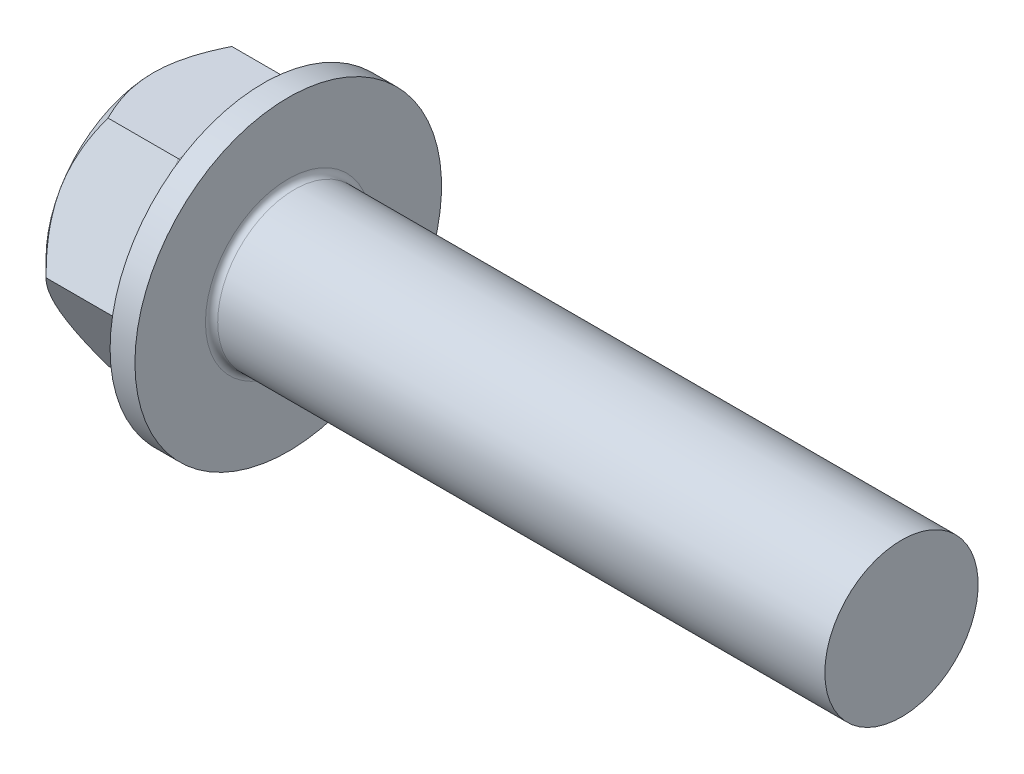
from build123d import *

# Parameters (mm, degrees)
HEAD_DEPTH     = 7.18
SKETCH3_R      = 5.95
EXTRUDE3_DEPTH = 1.436
FILLET1_R      = 1.5
FILLET2_R      = 0.4


with BuildPart() as part:
    # BodySke → BaseBody (revolve)
    with BuildSketch(Plane.XY, mode=Mode.PRIVATE) as basebody_sk:
        Polygon((0, 0), (0, 7), (7.18, 7), (7.18, 10), (8.8, 10), (8.8, 5), (48.8, 5), (48.8, 0), align=None)
    revolve(basebody_sk.sketch.rotate(Axis((0, 0, 0), (1, 0, 0)), 90), axis=Axis((0, 0, 0), (1, 0, 0)))

    # HeadSke → Head (add)
    with BuildSketch(Plane(origin=(0, 0, 0), x_dir=(0, 0, -1), z_dir=(1, 0, 0))):
        Polygon((8.082903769, 0), (4.041451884, 7), (-4.041451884, 7), (-8.082903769, 0), (-4.041451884, -7), (4.041451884, -7), align=None)
    extrude(amount=HEAD_DEPTH)

    # Sketch2 → Cut-Revolve1 (revolve, cut)
    with BuildSketch(Plane(origin=(0, 0, 0), x_dir=(1, 0, 0), z_dir=(0, 1, 0))):
        Polygon((-2, 7), (0, 7), (1.082903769, 8.082903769), (1.082903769, 10), (-2, 10), align=None)
    revolve(axis=Axis((0, 0, 0), (-1, 0, 0)), mode=Mode.SUBTRACT)

    # Sketch3 → Extrude3 (cut)
    with BuildSketch(Plane(origin=(0, 0, 0), x_dir=(0, 0, -1), z_dir=(1, 0, 0))):
        Circle(SKETCH3_R)
    extrude(amount=EXTRUDE3_DEPTH, mode=Mode.SUBTRACT)

    # Fillet1
    fillet1_edges = [part.edges().sort_by_distance(p)[0] for p in [
        (7.18, -3.5, 6.062177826),
        (7.18, -7, 0),
        (7.18, 3.5, 6.062177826),
        (7.18, 7, 0),
        (7.18, 3.5, -6.062177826),
        (7.18, -3.5, -6.062177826),
    ]]
    fillet(fillet1_edges, radius=FILLET1_R)

    # Fillet2
    fillet2_edges = [part.edges().sort_by_distance(p)[0] for p in [
        (8.8, 0, -5),
    ]]
    fillet(fillet2_edges, radius=FILLET2_R)


solid = part.part
